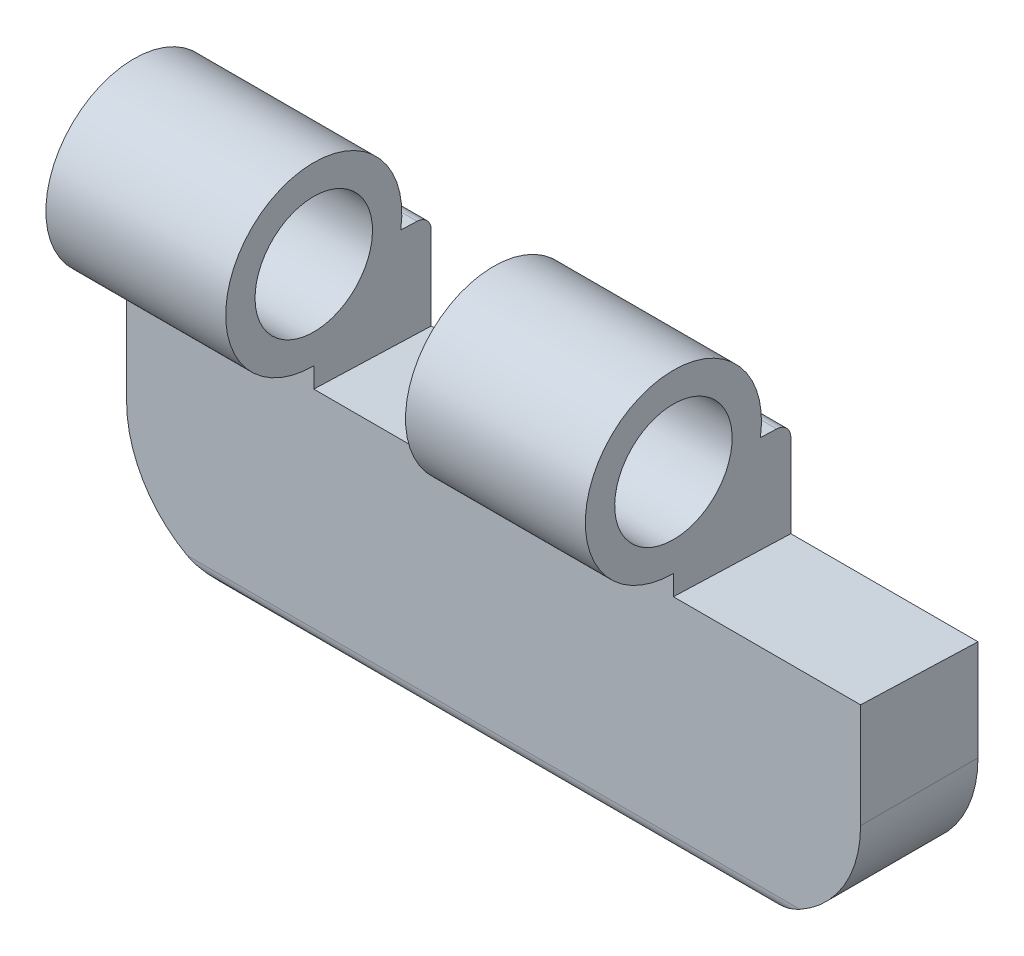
ISO-10303-21;
HEADER;
FILE_DESCRIPTION(('STEP AP214'),'2;1');
FILE_NAME('part.step','',(''),(''),'','','');
FILE_SCHEMA(('AUTOMOTIVE_DESIGN { 1 0 10303 214 1 1 1 1 }'));
ENDSEC;
DATA;
#1=APPLICATION_CONTEXT('core data for automotive mechanical design processes');
#2=APPLICATION_PROTOCOL_DEFINITION('international standard','automotive_design',2000,#1);
#3=PRODUCT_CONTEXT('',#1,'mechanical');
#4=PRODUCT('Part','Part','',(#3));
#5=PRODUCT_RELATED_PRODUCT_CATEGORY('part','',(#4));
#6=PRODUCT_DEFINITION_FORMATION('','',#4);
#7=PRODUCT_DEFINITION_CONTEXT('part definition',#1,'design');
#8=PRODUCT_DEFINITION('design','',#6,#7);
#9=PRODUCT_DEFINITION_SHAPE('','',#8);
#10=(LENGTH_UNIT() NAMED_UNIT(*) SI_UNIT(.MILLI.,.METRE.));
#11=(NAMED_UNIT(*) PLANE_ANGLE_UNIT() SI_UNIT($,.RADIAN.));
#12=(NAMED_UNIT(*) SI_UNIT($,.STERADIAN.) SOLID_ANGLE_UNIT());
#13=UNCERTAINTY_MEASURE_WITH_UNIT(LENGTH_MEASURE(1.E-05),#10,'distance_accuracy_value','');
#14=(GEOMETRIC_REPRESENTATION_CONTEXT(3) GLOBAL_UNCERTAINTY_ASSIGNED_CONTEXT((#13)) GLOBAL_UNIT_ASSIGNED_CONTEXT((#10,
#11,#12)) REPRESENTATION_CONTEXT('',''));
#15=CARTESIAN_POINT('',(0.,0.,0.));
#16=DIRECTION('',(0.,0.,1.));
#17=DIRECTION('',(1.,0.,0.));
#18=AXIS2_PLACEMENT_3D('',#15,#16,#17);
#19=CARTESIAN_POINT('',(-2.125,0.,7.));
#20=DIRECTION('',(0.,0.,1.));
#21=DIRECTION('',(-1.,0.,0.));
#22=AXIS2_PLACEMENT_3D('',#19,#20,#21);
#23=PLANE('',#22);
#24=CARTESIAN_POINT('',(0.,0.,7.));
#25=DIRECTION('',(0.,0.,-1.));
#26=DIRECTION('',(1.,0.,0.));
#27=AXIS2_PLACEMENT_3D('',#24,#25,#26);
#28=CIRCLE('',#27,4.25);
#29=CARTESIAN_POINT('',(4.25,0.,7.));
#30=VERTEX_POINT('',#29);
#31=EDGE_CURVE('E18',#30,#30,#28,.T.);
#32=ORIENTED_EDGE('',*,*,#31,.T.);
#33=EDGE_LOOP('',(#32));
#34=FACE_BOUND('',#33,.T.);
#35=ADVANCED_FACE('F14',(#34),#23,.F.);
#36=CARTESIAN_POINT('',(29.875,0.,7.));
#37=DIRECTION('',(0.,0.,1.));
#38=DIRECTION('',(-1.,0.,0.));
#39=AXIS2_PLACEMENT_3D('',#36,#37,#38);
#40=PLANE('',#39);
#41=CARTESIAN_POINT('',(32.,0.,7.));
#42=DIRECTION('',(0.,0.,-1.));
#43=DIRECTION('',(1.,0.,0.));
#44=AXIS2_PLACEMENT_3D('',#41,#42,#43);
#45=CIRCLE('',#44,4.25);
#46=CARTESIAN_POINT('',(36.25,0.,7.));
#47=VERTEX_POINT('',#46);
#48=EDGE_CURVE('E203',#47,#47,#45,.T.);
#49=ORIENTED_EDGE('',*,*,#48,.T.);
#50=EDGE_LOOP('',(#49));
#51=FACE_BOUND('',#50,.T.);
#52=ADVANCED_FACE('F448',(#51),#40,.F.);
#53=CARTESIAN_POINT('',(0.,0.,4.75));
#54=DIRECTION('',(0.,0.,-1.));
#55=DIRECTION('',(1.,0.,0.));
#56=AXIS2_PLACEMENT_3D('',#53,#54,#55);
#57=CYLINDRICAL_SURFACE('',#56,4.25);
#58=ORIENTED_EDGE('',*,*,#31,.F.);
#59=EDGE_LOOP('',(#58));
#60=FACE_BOUND('',#59,.T.);
#61=CARTESIAN_POINT('',(0.,0.,2.5));
#62=DIRECTION('',(0.,0.,-1.));
#63=DIRECTION('',(1.,0.,0.));
#64=AXIS2_PLACEMENT_3D('',#61,#62,#63);
#65=CIRCLE('',#64,4.25);
#66=CARTESIAN_POINT('',(4.25,0.,2.5));
#67=VERTEX_POINT('',#66);
#68=EDGE_CURVE('E433',#67,#67,#65,.T.);
#69=ORIENTED_EDGE('',*,*,#68,.T.);
#70=EDGE_LOOP('',(#69));
#71=FACE_BOUND('',#70,.T.);
#72=ADVANCED_FACE('F445',(#60,#71),#57,.F.);
#73=CARTESIAN_POINT('',(32.,0.,4.75));
#74=DIRECTION('',(0.,0.,-1.));
#75=DIRECTION('',(1.,0.,0.));
#76=AXIS2_PLACEMENT_3D('',#73,#74,#75);
#77=CYLINDRICAL_SURFACE('',#76,4.25);
#78=ORIENTED_EDGE('',*,*,#48,.F.);
#79=EDGE_LOOP('',(#78));
#80=FACE_BOUND('',#79,.T.);
#81=CARTESIAN_POINT('',(32.,0.,2.5));
#82=DIRECTION('',(0.,0.,-1.));
#83=DIRECTION('',(1.,0.,0.));
#84=AXIS2_PLACEMENT_3D('',#81,#82,#83);
#85=CIRCLE('',#84,4.25);
#86=CARTESIAN_POINT('',(36.25,0.,2.5));
#87=VERTEX_POINT('',#86);
#88=EDGE_CURVE('E132',#87,#87,#85,.T.);
#89=ORIENTED_EDGE('',*,*,#88,.T.);
#90=EDGE_LOOP('',(#89));
#91=FACE_BOUND('',#90,.T.);
#92=ADVANCED_FACE('F447',(#80,#91),#77,.F.);
#93=CARTESIAN_POINT('',(41.,4.85,0.));
#94=DIRECTION('',(0.,0.999390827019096,-0.034899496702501));
#95=DIRECTION('',(0.,-0.034899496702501,-0.999390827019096));
#96=AXIS2_PLACEMENT_3D('',#93,#94,#95);
#97=PLANE('',#96);
#98=DIRECTION('',(0.,0.0348994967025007,0.999390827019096));
#99=VECTOR('',#98,1.);
#100=CARTESIAN_POINT('',(-9.,4.85,0.));
#101=LINE('',#100,#99);
#102=CARTESIAN_POINT('',(-9.,4.85,0.));
#103=VERTEX_POINT('',#102);
#104=CARTESIAN_POINT('',(-9.,5.12936615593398,8.));
#105=VERTEX_POINT('',#104);
#106=EDGE_CURVE('E213',#103,#105,#101,.T.);
#107=ORIENTED_EDGE('',*,*,#106,.T.);
#108=DIRECTION('',(-1.,0.,0.));
#109=VECTOR('',#108,1.);
#110=CARTESIAN_POINT('',(41.,5.12936615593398,8.));
#111=LINE('',#110,#109);
#112=CARTESIAN_POINT('',(-8.5,5.12936615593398,8.));
#113=VERTEX_POINT('',#112);
#114=EDGE_CURVE('E190',#113,#105,#111,.T.);
#115=ORIENTED_EDGE('',*,*,#114,.F.);
#116=DIRECTION('',(0.,-0.0348994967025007,-0.999390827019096));
#117=VECTOR('',#116,1.);
#118=CARTESIAN_POINT('',(-8.5,5.12936615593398,8.));
#119=LINE('',#118,#117);
#120=CARTESIAN_POINT('',(-8.5,4.85,0.));
#121=VERTEX_POINT('',#120);
#122=EDGE_CURVE('E384',#113,#121,#119,.T.);
#123=ORIENTED_EDGE('',*,*,#122,.T.);
#124=DIRECTION('',(-1.,0.,0.));
#125=VECTOR('',#124,1.);
#126=CARTESIAN_POINT('',(41.,4.85,0.));
#127=LINE('',#126,#125);
#128=EDGE_CURVE('E200',#121,#103,#127,.T.);
#129=ORIENTED_EDGE('',*,*,#128,.T.);
#130=EDGE_LOOP('',(#107,#115,#123,#129));
#131=FACE_BOUND('',#130,.T.);
#132=ADVANCED_FACE('F455',(#131),#97,.T.);
#133=CARTESIAN_POINT('',(3.75,11.513702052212,0.965100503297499));
#134=DIRECTION('',(0.,0.999390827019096,-0.034899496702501));
#135=DIRECTION('',(0.,-0.034899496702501,-0.999390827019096));
#136=AXIS2_PLACEMENT_3D('',#133,#134,#135);
#137=PLANE('',#136);
#138=DIRECTION('',(0.,-0.034899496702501,-0.999390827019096));
#139=VECTOR('',#138,1.);
#140=CARTESIAN_POINT('',(3.75,11.513702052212,0.965100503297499));
#141=LINE('',#140,#139);
#142=CARTESIAN_POINT('',(3.75,11.5524707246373,2.07529002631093));
#143=VERTEX_POINT('',#142);
#144=CARTESIAN_POINT('',(3.75,11.513702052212,0.965100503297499));
#145=VERTEX_POINT('',#144);
#146=EDGE_CURVE('E193',#143,#145,#141,.T.);
#147=ORIENTED_EDGE('',*,*,#146,.T.);
#148=DIRECTION('',(1.,0.,0.));
#149=VECTOR('',#148,1.);
#150=CARTESIAN_POINT('',(3.75,11.513702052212,0.965100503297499));
#151=LINE('',#150,#149);
#152=CARTESIAN_POINT('',(-8.5,11.513702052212,0.965100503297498));
#153=VERTEX_POINT('',#152);
#154=EDGE_CURVE('E194',#153,#145,#151,.T.);
#155=ORIENTED_EDGE('',*,*,#154,.F.);
#156=DIRECTION('',(0.,0.0348994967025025,0.999390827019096));
#157=VECTOR('',#156,1.);
#158=CARTESIAN_POINT('',(-8.5,11.513702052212,0.965100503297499));
#159=LINE('',#158,#157);
#160=CARTESIAN_POINT('',(-8.5,11.5524707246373,2.07529002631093));
#161=VERTEX_POINT('',#160);
#162=EDGE_CURVE('E391',#153,#161,#159,.T.);
#163=ORIENTED_EDGE('',*,*,#162,.T.);
#164=DIRECTION('',(1.,0.,0.));
#165=VECTOR('',#164,1.);
#166=CARTESIAN_POINT('',(3.75,11.5524707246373,2.07529002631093));
#167=LINE('',#166,#165);
#168=EDGE_CURVE('E180',#143,#161,#167,.F.);
#169=ORIENTED_EDGE('',*,*,#168,.F.);
#170=EDGE_LOOP('',(#147,#155,#163,#169));
#171=FACE_BOUND('',#170,.T.);
#172=ADVANCED_FACE('F463',(#171),#137,.T.);
#173=CARTESIAN_POINT('',(3.75,12.5,8.));
#174=DIRECTION('',(1.,0.,0.));
#175=DIRECTION('',(0.,1.,0.));
#176=AXIS2_PLACEMENT_3D('',#173,#174,#175);
#177=CYLINDRICAL_SURFACE('',#176,4.);
#178=CARTESIAN_POINT('',(-8.5,12.5,8.));
#179=DIRECTION('',(1.,0.,0.));
#180=DIRECTION('',(0.,1.,0.));
#181=AXIS2_PLACEMENT_3D('',#178,#179,#180);
#182=CIRCLE('',#181,4.);
#183=CARTESIAN_POINT('',(-8.5,16.5,8.));
#184=VERTEX_POINT('',#183);
#185=EDGE_CURVE('E387',#184,#184,#182,.F.);
#186=ORIENTED_EDGE('',*,*,#185,.T.);
#187=EDGE_LOOP('',(#186));
#188=FACE_BOUND('',#187,.T.);
#189=CARTESIAN_POINT('',(3.75,12.5,8.));
#190=DIRECTION('',(1.,0.,0.));
#191=DIRECTION('',(0.,1.,0.));
#192=AXIS2_PLACEMENT_3D('',#189,#190,#191);
#193=CIRCLE('',#192,4.);
#194=CARTESIAN_POINT('',(3.75,16.5,8.));
#195=VERTEX_POINT('',#194);
#196=EDGE_CURVE('E197',#195,#195,#193,.F.);
#197=ORIENTED_EDGE('',*,*,#196,.F.);
#198=EDGE_LOOP('',(#197));
#199=FACE_BOUND('',#198,.T.);
#200=ADVANCED_FACE('F466',(#188,#199),#177,.F.);
#201=CARTESIAN_POINT('',(3.75,12.5,8.));
#202=DIRECTION('',(1.,0.,0.));
#203=DIRECTION('',(0.,1.,0.));
#204=AXIS2_PLACEMENT_3D('',#201,#202,#203);
#205=CYLINDRICAL_SURFACE('',#204,6.);
#206=DIRECTION('',(-1.,0.,0.));
#207=VECTOR('',#206,1.);
#208=CARTESIAN_POINT('',(41.,6.5,8.));
#209=LINE('',#208,#207);
#210=CARTESIAN_POINT('',(3.75,6.5,8.));
#211=VERTEX_POINT('',#210);
#212=CARTESIAN_POINT('',(-8.5,6.5,8.));
#213=VERTEX_POINT('',#212);
#214=EDGE_CURVE('E169',#211,#213,#209,.T.);
#215=ORIENTED_EDGE('',*,*,#214,.F.);
#216=CARTESIAN_POINT('',(3.75,12.5,8.));
#217=DIRECTION('',(1.,0.,0.));
#218=DIRECTION('',(0.,1.,0.));
#219=AXIS2_PLACEMENT_3D('',#216,#217,#218);
#220=CIRCLE('',#219,6.);
#221=EDGE_CURVE('E425',#143,#211,#220,.T.);
#222=ORIENTED_EDGE('',*,*,#221,.F.);
#223=ORIENTED_EDGE('',*,*,#168,.T.);
#224=CARTESIAN_POINT('',(-8.5,12.5,8.));
#225=DIRECTION('',(1.,0.,0.));
#226=DIRECTION('',(0.,1.,0.));
#227=AXIS2_PLACEMENT_3D('',#224,#225,#226);
#228=CIRCLE('',#227,6.);
#229=EDGE_CURVE('E428',#161,#213,#228,.T.);
#230=ORIENTED_EDGE('',*,*,#229,.T.);
#231=EDGE_LOOP('',(#215,#222,#223,#230));
#232=FACE_BOUND('',#231,.T.);
#233=ADVANCED_FACE('F470',(#232),#205,.T.);
#234=CARTESIAN_POINT('',(16.,11.5524707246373,2.07529002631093));
#235=DIRECTION('',(0.,0.999390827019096,-0.034899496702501));
#236=DIRECTION('',(0.,-0.034899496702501,-0.999390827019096));
#237=AXIS2_PLACEMENT_3D('',#234,#235,#236);
#238=PLANE('',#237);
#239=DIRECTION('',(0.,0.0348994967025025,0.999390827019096));
#240=VECTOR('',#239,1.);
#241=CARTESIAN_POINT('',(16.,11.513702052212,0.965100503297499));
#242=LINE('',#241,#240);
#243=CARTESIAN_POINT('',(16.,11.513702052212,0.965100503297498));
#244=VERTEX_POINT('',#243);
#245=CARTESIAN_POINT('',(16.,11.5524707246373,2.07529002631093));
#246=VERTEX_POINT('',#245);
#247=EDGE_CURVE('E184',#244,#246,#242,.T.);
#248=ORIENTED_EDGE('',*,*,#247,.T.);
#249=DIRECTION('',(-1.,0.,0.));
#250=VECTOR('',#249,1.);
#251=CARTESIAN_POINT('',(16.,11.5524707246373,2.07529002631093));
#252=LINE('',#251,#250);
#253=CARTESIAN_POINT('',(28.25,11.5524707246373,2.07529002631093));
#254=VERTEX_POINT('',#253);
#255=EDGE_CURVE('E170',#254,#246,#252,.T.);
#256=ORIENTED_EDGE('',*,*,#255,.F.);
#257=DIRECTION('',(0.,-0.034899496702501,-0.999390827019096));
#258=VECTOR('',#257,1.);
#259=CARTESIAN_POINT('',(28.25,11.5524707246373,2.07529002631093));
#260=LINE('',#259,#258);
#261=CARTESIAN_POINT('',(28.25,11.513702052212,0.965100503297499));
#262=VERTEX_POINT('',#261);
#263=EDGE_CURVE('E173',#254,#262,#260,.T.);
#264=ORIENTED_EDGE('',*,*,#263,.T.);
#265=DIRECTION('',(-1.,0.,0.));
#266=VECTOR('',#265,1.);
#267=CARTESIAN_POINT('',(16.,11.513702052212,0.9651005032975));
#268=LINE('',#267,#266);
#269=EDGE_CURVE('E174',#244,#262,#268,.F.);
#270=ORIENTED_EDGE('',*,*,#269,.F.);
#271=EDGE_LOOP('',(#248,#256,#264,#270));
#272=FACE_BOUND('',#271,.T.);
#273=ADVANCED_FACE('F474',(#272),#238,.T.);
#274=CARTESIAN_POINT('',(16.,12.5,8.));
#275=DIRECTION('',(-1.,0.,0.));
#276=DIRECTION('',(0.,-1.,0.));
#277=AXIS2_PLACEMENT_3D('',#274,#275,#276);
#278=CYLINDRICAL_SURFACE('',#277,4.);
#279=CARTESIAN_POINT('',(16.,12.5,8.));
#280=DIRECTION('',(-1.,0.,0.));
#281=DIRECTION('',(0.,-1.,0.));
#282=AXIS2_PLACEMENT_3D('',#279,#280,#281);
#283=CIRCLE('',#282,4.);
#284=CARTESIAN_POINT('',(16.,8.5,8.));
#285=VERTEX_POINT('',#284);
#286=EDGE_CURVE('E358',#285,#285,#283,.T.);
#287=ORIENTED_EDGE('',*,*,#286,.T.);
#288=EDGE_LOOP('',(#287));
#289=FACE_BOUND('',#288,.T.);
#290=CARTESIAN_POINT('',(28.25,12.5,8.));
#291=DIRECTION('',(-1.,0.,0.));
#292=DIRECTION('',(0.,-1.,0.));
#293=AXIS2_PLACEMENT_3D('',#290,#291,#292);
#294=CIRCLE('',#293,4.);
#295=CARTESIAN_POINT('',(28.25,8.5,8.));
#296=VERTEX_POINT('',#295);
#297=EDGE_CURVE('E177',#296,#296,#294,.T.);
#298=ORIENTED_EDGE('',*,*,#297,.F.);
#299=EDGE_LOOP('',(#298));
#300=FACE_BOUND('',#299,.T.);
#301=ADVANCED_FACE('F478',(#289,#300),#278,.F.);
#302=CARTESIAN_POINT('',(16.,12.5,8.));
#303=DIRECTION('',(-1.,0.,0.));
#304=DIRECTION('',(0.,-1.,0.));
#305=AXIS2_PLACEMENT_3D('',#302,#303,#304);
#306=CYLINDRICAL_SURFACE('',#305,6.);
#307=DIRECTION('',(-1.,0.,0.));
#308=VECTOR('',#307,1.);
#309=CARTESIAN_POINT('',(41.,6.5,8.));
#310=LINE('',#309,#308);
#311=CARTESIAN_POINT('',(28.25,6.5,8.));
#312=VERTEX_POINT('',#311);
#313=CARTESIAN_POINT('',(16.,6.5,8.));
#314=VERTEX_POINT('',#313);
#315=EDGE_CURVE('E166',#312,#314,#310,.T.);
#316=ORIENTED_EDGE('',*,*,#315,.F.);
#317=CARTESIAN_POINT('',(28.25,12.5,8.));
#318=DIRECTION('',(-1.,0.,0.));
#319=DIRECTION('',(0.,-1.,0.));
#320=AXIS2_PLACEMENT_3D('',#317,#318,#319);
#321=CIRCLE('',#320,6.);
#322=EDGE_CURVE('E237',#254,#312,#321,.F.);
#323=ORIENTED_EDGE('',*,*,#322,.F.);
#324=ORIENTED_EDGE('',*,*,#255,.T.);
#325=CARTESIAN_POINT('',(16.,12.5,8.));
#326=DIRECTION('',(-1.,0.,0.));
#327=DIRECTION('',(0.,-1.,0.));
#328=AXIS2_PLACEMENT_3D('',#325,#326,#327);
#329=CIRCLE('',#328,6.);
#330=EDGE_CURVE('E416',#246,#314,#329,.F.);
#331=ORIENTED_EDGE('',*,*,#330,.T.);
#332=EDGE_LOOP('',(#316,#323,#324,#331));
#333=FACE_BOUND('',#332,.T.);
#334=ADVANCED_FACE('F481',(#333),#306,.T.);
#335=CARTESIAN_POINT('',(41.,5.12936615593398,8.));
#336=DIRECTION('',(0.,0.,1.));
#337=DIRECTION('',(-1.,0.,0.));
#338=AXIS2_PLACEMENT_3D('',#335,#336,#337);
#339=PLANE('',#338);
#340=ORIENTED_EDGE('',*,*,#114,.T.);
#341=DIRECTION('',(0.,1.,0.));
#342=VECTOR('',#341,1.);
#343=CARTESIAN_POINT('',(-9.,12.5,8.));
#344=LINE('',#343,#342);
#345=CARTESIAN_POINT('',(-9.,-2.,8.));
#346=VERTEX_POINT('',#345);
#347=EDGE_CURVE('E210',#105,#346,#344,.F.);
#348=ORIENTED_EDGE('',*,*,#347,.T.);
#349=CARTESIAN_POINT('',(-1.,-2.,8.));
#350=DIRECTION('',(0.,0.,-1.));
#351=DIRECTION('',(1.,0.,0.));
#352=AXIS2_PLACEMENT_3D('',#349,#350,#351);
#353=CIRCLE('',#352,8.);
#354=CARTESIAN_POINT('',(-4.8729833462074,-9.,8.));
#355=VERTEX_POINT('',#354);
#356=EDGE_CURVE('E131',#355,#346,#353,.T.);
#357=ORIENTED_EDGE('',*,*,#356,.F.);
#358=DIRECTION('',(1.,0.,0.));
#359=VECTOR('',#358,1.);
#360=CARTESIAN_POINT('',(41.,-9.,8.));
#361=LINE('',#360,#359);
#362=CARTESIAN_POINT('',(36.8729833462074,-9.,8.));
#363=VERTEX_POINT('',#362);
#364=EDGE_CURVE('E127',#363,#355,#361,.F.);
#365=ORIENTED_EDGE('',*,*,#364,.F.);
#366=CARTESIAN_POINT('',(33.,-2.,8.));
#367=DIRECTION('',(0.,0.,-1.));
#368=DIRECTION('',(1.,0.,0.));
#369=AXIS2_PLACEMENT_3D('',#366,#367,#368);
#370=CIRCLE('',#369,8.);
#371=CARTESIAN_POINT('',(41.,-2.,8.));
#372=VERTEX_POINT('',#371);
#373=EDGE_CURVE('E141',#372,#363,#370,.T.);
#374=ORIENTED_EDGE('',*,*,#373,.F.);
#375=DIRECTION('',(0.,1.,0.));
#376=VECTOR('',#375,1.);
#377=CARTESIAN_POINT('',(41.,12.5,8.));
#378=LINE('',#377,#376);
#379=CARTESIAN_POINT('',(41.,5.12936615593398,8.));
#380=VERTEX_POINT('',#379);
#381=EDGE_CURVE('E154',#380,#372,#378,.F.);
#382=ORIENTED_EDGE('',*,*,#381,.F.);
#383=DIRECTION('',(-1.,0.,0.));
#384=VECTOR('',#383,1.);
#385=CARTESIAN_POINT('',(41.,5.12936615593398,8.));
#386=LINE('',#385,#384);
#387=CARTESIAN_POINT('',(28.25,5.12936615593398,8.));
#388=VERTEX_POINT('',#387);
#389=EDGE_CURVE('E160',#388,#380,#386,.F.);
#390=ORIENTED_EDGE('',*,*,#389,.F.);
#391=DIRECTION('',(0.,1.,0.));
#392=VECTOR('',#391,1.);
#393=CARTESIAN_POINT('',(28.25,12.5,8.));
#394=LINE('',#393,#392);
#395=EDGE_CURVE('E339',#312,#388,#394,.F.);
#396=ORIENTED_EDGE('',*,*,#395,.F.);
#397=ORIENTED_EDGE('',*,*,#315,.T.);
#398=DIRECTION('',(0.,1.,0.));
#399=VECTOR('',#398,1.);
#400=CARTESIAN_POINT('',(16.,12.5,8.));
#401=LINE('',#400,#399);
#402=CARTESIAN_POINT('',(16.,5.12936615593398,8.));
#403=VERTEX_POINT('',#402);
#404=EDGE_CURVE('E359',#314,#403,#401,.F.);
#405=ORIENTED_EDGE('',*,*,#404,.T.);
#406=DIRECTION('',(-1.,0.,0.));
#407=VECTOR('',#406,1.);
#408=CARTESIAN_POINT('',(41.,5.12936615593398,8.));
#409=LINE('',#408,#407);
#410=CARTESIAN_POINT('',(3.75,5.12936615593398,8.));
#411=VERTEX_POINT('',#410);
#412=EDGE_CURVE('E181',#411,#403,#409,.F.);
#413=ORIENTED_EDGE('',*,*,#412,.F.);
#414=DIRECTION('',(0.,1.,0.));
#415=VECTOR('',#414,1.);
#416=CARTESIAN_POINT('',(3.75,12.5,8.));
#417=LINE('',#416,#415);
#418=EDGE_CURVE('E369',#211,#411,#417,.F.);
#419=ORIENTED_EDGE('',*,*,#418,.F.);
#420=ORIENTED_EDGE('',*,*,#214,.T.);
#421=DIRECTION('',(0.,1.,0.));
#422=VECTOR('',#421,1.);
#423=CARTESIAN_POINT('',(-8.5,12.5,8.));
#424=LINE('',#423,#422);
#425=EDGE_CURVE('E388',#213,#113,#424,.F.);
#426=ORIENTED_EDGE('',*,*,#425,.T.);
#427=EDGE_LOOP('',(#340,#348,#357,#365,#374,#382,#390,#396,#397,#405,#413,#419,#420,#426));
#428=FACE_BOUND('',#427,.T.);
#429=ADVANCED_FACE('F248',(#428),#339,.T.);
#430=CARTESIAN_POINT('',(41.,-9.,7.));
#431=DIRECTION('',(1.,0.,0.));
#432=DIRECTION('',(0.,1.,0.));
#433=AXIS2_PLACEMENT_3D('',#430,#431,#432);
#434=CYLINDRICAL_SURFACE('',#433,1.);
#435=CARTESIAN_POINT('',(36.8729833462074,-9.,8.));
#436=CARTESIAN_POINT('',(36.8150611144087,-9.03204875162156,7.99999095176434));
#437=CARTESIAN_POINT('',(36.7567590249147,-9.06336585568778,7.99846056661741));
#438=CARTESIAN_POINT('',(36.6395251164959,-9.12448038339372,7.99269833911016));
#439=CARTESIAN_POINT('',(36.5805935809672,-9.15427845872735,7.98846766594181));
#440=CARTESIAN_POINT('',(36.4032423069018,-9.24121872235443,7.97225892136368));
#441=CARTESIAN_POINT('',(36.2840024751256,-9.2960525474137,7.95676097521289));
#442=CARTESIAN_POINT('',(36.0445697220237,-9.39915667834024,7.91852145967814));
#443=CARTESIAN_POINT('',(35.9243835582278,-9.447455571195,7.89581299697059));
#444=CARTESIAN_POINT('',(35.6828286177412,-9.53784294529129,7.84464292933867));
#445=CARTESIAN_POINT('',(35.5614590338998,-9.57992681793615,7.81617709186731));
#446=CARTESIAN_POINT('',(35.2403850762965,-9.68273685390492,7.73517218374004));
#447=CARTESIAN_POINT('',(35.0399619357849,-9.73829278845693,7.6788382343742));
#448=CARTESIAN_POINT('',(34.6377980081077,-9.83328651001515,7.55814944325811));
#449=CARTESIAN_POINT('',(34.4360567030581,-9.87271752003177,7.49379124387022));
#450=CARTESIAN_POINT('',(33.8292935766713,-9.96742194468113,7.29320124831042));
#451=CARTESIAN_POINT('',(33.422667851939,-9.99912712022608,7.14943568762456));
#452=CARTESIAN_POINT('',(33.0112434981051,-9.99999406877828,7.00397515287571));
#453=CARTESIAN_POINT('',(33.005621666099,-9.99999999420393,7.00198753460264));
#454=CARTESIAN_POINT('',(33.,-10.,7.));
#455=B_SPLINE_CURVE_WITH_KNOTS('',3,(#435,#436,#437,#438,#439,#440,#441,#442,#443,#444,#445,
#446,#447,#448,#449,#450,#451,#452,#453,#454),.UNSPECIFIED.,.F.,.F.,(4,2,2,2,2,2,2,2,2,4),(0.,
0.198535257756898,0.396984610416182,0.792983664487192,1.18719018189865,1.58168756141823,
2.22713013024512,2.87284368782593,4.16406208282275,4.18195063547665),.UNSPECIFIED.);
#456=CARTESIAN_POINT('',(33.,-10.,7.));
#457=VERTEX_POINT('',#456);
#458=EDGE_CURVE('E156',#363,#457,#455,.T.);
#459=ORIENTED_EDGE('',*,*,#458,.F.);
#460=ORIENTED_EDGE('',*,*,#364,.T.);
#461=CARTESIAN_POINT('',(-1.,-10.,7.));
#462=CARTESIAN_POINT('',(-0.999999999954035,-10.,7.00000113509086));
#463=CARTESIAN_POINT('',(-1.00000028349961,-9.9999999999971,7.00000227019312));
#464=CARTESIAN_POINT('',(-1.0000011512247,-9.99999999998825,7.00000443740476));
#465=CARTESIAN_POINT('',(-1.00000174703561,-9.99999999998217,7.00000546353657));
#466=CARTESIAN_POINT('',(-1.00000317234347,-9.99999999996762,7.00000752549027));
#467=CARTESIAN_POINT('',(-1.00000402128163,-9.99999999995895,7.00000854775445));
#468=CARTESIAN_POINT('',(-1.00000583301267,-9.99999999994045,7.0000104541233));
#469=CARTESIAN_POINT('',(-1.00000679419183,-9.99999999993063,7.00001133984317));
#470=CARTESIAN_POINT('',(-1.00001030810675,-9.99999999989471,7.00001438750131));
#471=CARTESIAN_POINT('',(-1.00001300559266,-9.99999999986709,7.0000163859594));
#472=CARTESIAN_POINT('',(-1.00001851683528,-9.99999999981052,7.00001987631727));
#473=CARTESIAN_POINT('',(-1.00002131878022,-9.99999999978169,7.00002138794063));
#474=CARTESIAN_POINT('',(-1.00003250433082,-9.99999999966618,7.00002724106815));
#475=CARTESIAN_POINT('',(-1.00004104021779,-9.99999999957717,7.0000313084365));
#476=CARTESIAN_POINT('',(-1.00005767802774,-9.99999999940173,7.00003778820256));
#477=CARTESIAN_POINT('',(-1.00006573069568,-9.99999999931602,7.00004032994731));
#478=CARTESIAN_POINT('',(-1.00010070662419,-9.99999999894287,7.00005141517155));
#479=CARTESIAN_POINT('',(-1.00012758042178,-9.99999999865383,7.00006004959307));
#480=CARTESIAN_POINT('',(-1.00017747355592,-9.99999999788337,7.00007361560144));
#481=CARTESIAN_POINT('',(-1.00020038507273,-9.99999999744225,7.0000789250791));
#482=CARTESIAN_POINT('',(-1.00036969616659,-9.99999999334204,7.00012172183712));
#483=CARTESIAN_POINT('',(-1.00051077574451,-9.9999999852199,7.00017732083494));
#484=CARTESIAN_POINT('',(-1.00106355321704,-9.9999999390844,7.00038730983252));
#485=CARTESIAN_POINT('',(-1.00147894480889,-9.99999987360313,7.00052818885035));
#486=CARTESIAN_POINT('',(-1.00310652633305,-9.99999949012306,7.00108820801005));
#487=CARTESIAN_POINT('',(-1.00431494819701,-9.99999892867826,7.00152150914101));
#488=CARTESIAN_POINT('',(-1.00930137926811,-9.9999954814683,7.00330123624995));
#489=CARTESIAN_POINT('',(-1.0130835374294,-9.99999019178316,7.00463162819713));
#490=CARTESIAN_POINT('',(-1.06010383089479,-9.99989110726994,7.0211821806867));
#491=CARTESIAN_POINT('',(-1.1033150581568,-9.9994497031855,7.03650704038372));
#492=CARTESIAN_POINT('',(-1.19040332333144,-9.99785412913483,7.0673077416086));
#493=CARTESIAN_POINT('',(-1.23428051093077,-9.99668924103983,7.08278234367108));
#494=CARTESIAN_POINT('',(-1.36187675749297,-9.99225031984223,7.12773209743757));
#495=CARTESIAN_POINT('',(-1.44558376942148,-9.9880215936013,7.15715678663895));
#496=CARTESIAN_POINT('',(-1.62314876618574,-9.97624836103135,7.21921672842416));
#497=CARTESIAN_POINT('',(-1.71700007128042,-9.9683624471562,7.25180602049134));
#498=CARTESIAN_POINT('',(-1.90558764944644,-9.94915023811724,7.31665261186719));
#499=CARTESIAN_POINT('',(-2.00032279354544,-9.93778846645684,7.34890276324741));
#500=CARTESIAN_POINT('',(-2.16430735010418,-9.91513020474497,7.40394308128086));
#501=CARTESIAN_POINT('',(-2.23359300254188,-9.90462980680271,7.42695538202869));
#502=CARTESIAN_POINT('',(-2.37188825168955,-9.88180321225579,7.47229823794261));
#503=CARTESIAN_POINT('',(-2.44089810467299,-9.86948166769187,7.49463036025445));
#504=CARTESIAN_POINT('',(-2.64458796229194,-9.83033569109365,7.55951422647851));
#505=CARTESIAN_POINT('',(-2.77910596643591,-9.80089013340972,7.60102919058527));
#506=CARTESIAN_POINT('',(-3.06607885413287,-9.73020509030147,7.6857492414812));
#507=CARTESIAN_POINT('',(-3.21843949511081,-9.6878973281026,7.72839300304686));
#508=CARTESIAN_POINT('',(-3.52307620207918,-9.59339942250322,7.80727586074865));
#509=CARTESIAN_POINT('',(-3.67534332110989,-9.54113855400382,7.84346529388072));
#510=CARTESIAN_POINT('',(-3.98767848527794,-9.4231617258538,7.90871697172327));
#511=CARTESIAN_POINT('',(-4.14763649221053,-9.356807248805,7.93718950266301));
#512=CARTESIAN_POINT('',(-4.38500747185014,-9.24908682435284,7.96919937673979));
#513=CARTESIAN_POINT('',(-4.46360517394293,-9.21186772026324,7.97808165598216));
#514=CARTESIAN_POINT('',(-4.61982425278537,-9.13473562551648,7.99165592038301));
#515=CARTESIAN_POINT('',(-4.6974459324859,-9.09482349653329,7.99634923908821));
#516=CARTESIAN_POINT('',(-4.84604497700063,-9.01530699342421,8.000618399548));
#517=CARTESIAN_POINT('',(-4.91710588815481,-8.97587815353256,8.00053073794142));
#518=CARTESIAN_POINT('',(-5.0578345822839,-8.89496625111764,7.99529461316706));
#519=CARTESIAN_POINT('',(-5.12750303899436,-8.85348421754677,7.99014866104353));
#520=CARTESIAN_POINT('',(-5.26405536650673,-8.76935502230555,7.97396695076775));
#521=CARTESIAN_POINT('',(-5.33096501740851,-8.72673363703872,7.9630180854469));
#522=CARTESIAN_POINT('',(-5.46240376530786,-8.64026548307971,7.93416664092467));
#523=CARTESIAN_POINT('',(-5.52693535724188,-8.59642008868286,7.91627159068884));
#524=CARTESIAN_POINT('',(-5.64559887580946,-8.51329739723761,7.87465801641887));
#525=CARTESIAN_POINT('',(-5.7000763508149,-8.47407086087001,7.85183904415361));
#526=CARTESIAN_POINT('',(-5.80576920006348,-8.39600685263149,7.79839598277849));
#527=CARTESIAN_POINT('',(-5.85697371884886,-8.35717100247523,7.76774745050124));
#528=CARTESIAN_POINT('',(-5.95510168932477,-8.28099249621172,7.69697158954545));
#529=CARTESIAN_POINT('',(-6.00196558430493,-8.24367370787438,7.65673364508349));
#530=CARTESIAN_POINT('',(-6.08831139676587,-8.17350433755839,7.56583531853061));
#531=CARTESIAN_POINT('',(-6.12782354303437,-8.14063561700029,7.51521949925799));
#532=CARTESIAN_POINT('',(-6.18254940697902,-8.09441693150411,7.42584158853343));
#533=CARTESIAN_POINT('',(-6.20115325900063,-8.07852521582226,7.39046500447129));
#534=CARTESIAN_POINT('',(-6.23373860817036,-8.05049089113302,7.31623102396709));
#535=CARTESIAN_POINT('',(-6.24772270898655,-8.03834617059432,7.27737560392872));
#536=CARTESIAN_POINT('',(-6.2703155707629,-8.01863814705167,7.19663930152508));
#537=CARTESIAN_POINT('',(-6.27888107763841,-8.01111172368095,7.15473697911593));
#538=CARTESIAN_POINT('',(-6.28980566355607,-8.00150083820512,7.06951996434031));
#539=CARTESIAN_POINT('',(-6.29216891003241,-7.99941272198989,7.026206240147));
#540=CARTESIAN_POINT('',(-6.29060372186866,-8.00079245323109,6.94474406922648));
#541=CARTESIAN_POINT('',(-6.28736099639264,-8.00365479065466,6.90656900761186));
#542=CARTESIAN_POINT('',(-6.27608015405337,-8.01357080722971,6.83150415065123));
#543=CARTESIAN_POINT('',(-6.26804175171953,-8.0206247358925,6.79461443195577));
#544=CARTESIAN_POINT('',(-6.24763954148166,-8.03841531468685,6.7230221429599));
#545=CARTESIAN_POINT('',(-6.23527697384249,-8.04915090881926,6.68831894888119));
#546=CARTESIAN_POINT('',(-6.20682543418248,-8.0736580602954,6.62164204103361));
#547=CARTESIAN_POINT('',(-6.19073501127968,-8.08743079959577,6.58966939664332));
#548=CARTESIAN_POINT('',(-6.14662481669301,-8.12482193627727,6.51353356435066));
#549=CARTESIAN_POINT('',(-6.11665453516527,-8.1499279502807,6.47122794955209));
#550=CARTESIAN_POINT('',(-6.05145565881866,-8.20359523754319,6.39338041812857));
#551=CARTESIAN_POINT('',(-6.01621335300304,-8.23216548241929,6.35785670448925));
#552=CARTESIAN_POINT('',(-5.92342831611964,-8.30593848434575,6.27710305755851));
#553=CARTESIAN_POINT('',(-5.86348485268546,-8.3523713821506,6.23577826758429));
#554=CARTESIAN_POINT('',(-5.73805560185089,-8.44647313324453,6.16508899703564));
#555=CARTESIAN_POINT('',(-5.67256771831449,-8.49414244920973,6.1357290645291));
#556=CARTESIAN_POINT('',(-5.54899064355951,-8.58114123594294,6.0908615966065));
#557=CARTESIAN_POINT('',(-5.49147527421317,-8.62054289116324,6.07386434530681));
#558=CARTESIAN_POINT('',(-5.37442560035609,-8.69845863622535,6.04564606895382));
#559=CARTESIAN_POINT('',(-5.31488985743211,-8.73697205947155,6.03442925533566));
#560=CARTESIAN_POINT('',(-5.19368651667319,-8.81308803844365,6.01683930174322));
#561=CARTESIAN_POINT('',(-5.13200327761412,-8.85067712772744,6.01051723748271));
#562=CARTESIAN_POINT('',(-5.00741560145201,-8.92429511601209,6.00218245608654));
#563=CARTESIAN_POINT('',(-4.94451071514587,-8.96032342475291,6.00017135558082));
#564=CARTESIAN_POINT('',(-4.76515668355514,-9.05982720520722,5.99971528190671));
#565=CARTESIAN_POINT('',(-4.64756702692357,-9.12128551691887,6.00561103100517));
#566=CARTESIAN_POINT('',(-4.41001555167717,-9.23805041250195,6.0269343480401));
#567=CARTESIAN_POINT('',(-4.29004934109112,-9.29334404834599,6.04238154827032));
#568=CARTESIAN_POINT('',(-4.05398728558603,-9.39519686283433,6.07987570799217));
#569=CARTESIAN_POINT('',(-3.9379590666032,-9.44203650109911,6.10159571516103));
#570=CARTESIAN_POINT('',(-3.70547967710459,-9.52965677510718,6.15031611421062));
#571=CARTESIAN_POINT('',(-3.58903404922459,-9.57046834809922,6.17728777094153));
#572=CARTESIAN_POINT('',(-3.38514241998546,-9.63671900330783,6.22808125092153));
#573=CARTESIAN_POINT('',(-3.2978660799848,-9.66342560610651,6.25095500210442));
#574=CARTESIAN_POINT('',(-3.12300858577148,-9.71369594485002,6.29868771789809));
#575=CARTESIAN_POINT('',(-3.03542762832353,-9.73726142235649,6.32354557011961));
#576=CARTESIAN_POINT('',(-2.85800422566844,-9.78179758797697,6.37550850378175));
#577=CARTESIAN_POINT('',(-2.7681552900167,-9.8026978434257,6.40265160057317));
#578=CARTESIAN_POINT('',(-2.58799361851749,-9.84135101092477,6.45844393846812));
#579=CARTESIAN_POINT('',(-2.49768028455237,-9.85909588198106,6.48709679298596));
#580=CARTESIAN_POINT('',(-2.28535804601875,-9.89703696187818,6.55575478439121));
#581=CARTESIAN_POINT('',(-2.16326968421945,-9.91593303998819,6.59623687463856));
#582=CARTESIAN_POINT('',(-1.92013032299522,-9.94784475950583,6.67827533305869));
#583=CARTESIAN_POINT('',(-1.79908182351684,-9.96091981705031,6.7198160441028));
#584=CARTESIAN_POINT('',(-1.62411162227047,-9.97580124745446,6.78049617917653));
#585=CARTESIAN_POINT('',(-1.57024208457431,-9.97983325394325,6.79926513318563));
#586=CARTESIAN_POINT('',(-1.46226195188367,-9.9868174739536,6.83702493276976));
#587=CARTESIAN_POINT('',(-1.40815126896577,-9.98976522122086,6.85601637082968));
#588=CARTESIAN_POINT('',(-1.29741873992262,-9.99467024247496,6.8949519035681));
#589=CARTESIAN_POINT('',(-1.24079596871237,-9.99657567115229,6.91489960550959));
#590=CARTESIAN_POINT('',(-1.12841584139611,-9.9991638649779,6.95462479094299));
#591=CARTESIAN_POINT('',(-1.07265832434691,-9.9998646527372,6.97440029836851));
#592=CARTESIAN_POINT('',(-1.01308246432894,-9.99999019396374,6.99536864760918));
#593=CARTESIAN_POINT('',(-1.00929927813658,-9.99999548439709,6.99669948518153));
#594=CARTESIAN_POINT('',(-1.00431260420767,-9.99999892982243,6.99847932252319));
#595=CARTESIAN_POINT('',(-1.00310497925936,-9.99999949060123,6.99891233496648));
#596=CARTESIAN_POINT('',(-1.00147840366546,-9.99999987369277,6.99947200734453));
#597=CARTESIAN_POINT('',(-1.00106321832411,-9.99999993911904,6.9996128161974));
#598=CARTESIAN_POINT('',(-1.00051068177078,-9.9999999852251,6.99982271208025));
#599=CARTESIAN_POINT('',(-1.00036963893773,-9.99999999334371,6.99987829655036));
#600=CARTESIAN_POINT('',(-1.00020036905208,-9.99999999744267,6.99992108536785));
#601=CARTESIAN_POINT('',(-1.00017746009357,-9.99999999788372,6.99992639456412));
#602=CARTESIAN_POINT('',(-1.00012757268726,-9.99999999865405,6.9999399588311));
#603=CARTESIAN_POINT('',(-1.00010070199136,-9.99999999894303,6.99994859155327));
#604=CARTESIAN_POINT('',(-1.00006572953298,-9.99999999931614,6.99995967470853));
#605=CARTESIAN_POINT('',(-1.00005767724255,-9.99999999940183,6.99996221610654));
#606=CARTESIAN_POINT('',(-1.00004104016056,-9.99999999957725,6.99996869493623));
#607=CARTESIAN_POINT('',(-1.0000325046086,-9.99999999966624,6.99997276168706));
#608=CARTESIAN_POINT('',(-1.00002131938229,-9.99999999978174,6.999978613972));
#609=CARTESIAN_POINT('',(-1.00001851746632,-9.99999999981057,6.99998012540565));
#610=CARTESIAN_POINT('',(-1.00001300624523,-9.99999999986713,6.99998361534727));
#611=CARTESIAN_POINT('',(-1.00001030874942,-9.99999999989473,6.99998561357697));
#612=CARTESIAN_POINT('',(-1.00000679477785,-9.99999999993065,6.99998866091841));
#613=CARTESIAN_POINT('',(-1.00000583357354,-9.99999999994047,6.99998954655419));
#614=CARTESIAN_POINT('',(-1.00000402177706,-9.99999999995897,6.99999145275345));
#615=CARTESIAN_POINT('',(-1.00000317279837,-9.99999999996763,6.99999247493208));
#616=CARTESIAN_POINT('',(-1.00000174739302,-9.99999999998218,6.99999453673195));
#617=CARTESIAN_POINT('',(-1.00000115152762,-9.99999999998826,6.99999556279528));
#618=CARTESIAN_POINT('',(-1.00000028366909,-9.99999999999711,6.99999772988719));
#619=CARTESIAN_POINT('',(-1.00000000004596,-10.,6.9999988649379));
#620=CARTESIAN_POINT('',(-1.,-10.,7.));
#621=B_SPLINE_CURVE_WITH_KNOTS('',3,(#461,#462,#463,#464,#465,#466,#467,#468,#469,#470,#471,
#472,#473,#474,#475,#476,#477,#478,#479,#480,#481,#482,#483,#484,#485,#486,#487,#488,#489,#490,
#491,#492,#493,#494,#495,#496,#497,#498,#499,#500,#501,#502,#503,#504,#505,#506,#507,#508,#509,
#510,#511,#512,#513,#514,#515,#516,#517,#518,#519,#520,#521,#522,#523,#524,#525,#526,#527,#528,
#529,#530,#531,#532,#533,#534,#535,#536,#537,#538,#539,#540,#541,#542,#543,#544,#545,#546,#547,
#548,#549,#550,#551,#552,#553,#554,#555,#556,#557,#558,#559,#560,#561,#562,#563,#564,#565,#566,
#567,#568,#569,#570,#571,#572,#573,#574,#575,#576,#577,#578,#579,#580,#581,#582,#583,#584,#585,
#586,#587,#588,#589,#590,#591,#592,#593,#594,#595,#596,#597,#598,#599,#600,#601,#602,#603,#604,
#605,#606,#607,#608,#609,#610,#611,#612,#613,#614,#615,#616,#617,#618,#619,#620),.UNSPECIFIED.,
.T.,.F.,(4,2,2,2,2,2,2,2,2,2,2,2,2,2,2,2,2,2,2,2,2,2,2,2,2,2,2,2,2,2,2,2,2,2,2,2,2,2,2,2,2,2,2,
2,2,2,2,2,2,2,2,2,2,2,2,2,2,2,2,2,2,2,2,2,2,2,2,2,2,2,2,2,2,2,2,2,2,2,2,4),(0.,
3.40698807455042E-06,6.95098753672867E-06,1.09194301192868E-05,1.48365709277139E-05,
2.48615345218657E-05,3.44048785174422E-05,6.26951660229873E-05,8.80001725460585E-05,
0.000172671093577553,0.000243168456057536,0.000696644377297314,0.00201374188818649,
0.0058634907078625,0.0178931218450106,0.155425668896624,0.295045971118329,0.561488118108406,
0.86041553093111,1.16250194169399,1.38375265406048,1.60444765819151,2.0357002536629,
2.52663985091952,3.02120774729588,3.54680912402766,3.80894423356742,4.07099586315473,
4.31462921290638,4.55814167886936,4.7981067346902,5.0378124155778,5.25011637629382,
5.46309140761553,5.67865342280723,5.89330849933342,6.02188854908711,6.15039600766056,
6.27991674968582,6.40935044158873,6.52404735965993,6.63875110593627,6.7534219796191,
6.86813755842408,7.03997635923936,7.2122700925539,7.46988659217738,7.72760092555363,
7.94258106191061,8.15771760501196,8.37506987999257,8.59250364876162,8.99026222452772,
9.38884109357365,9.76954965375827,10.1482308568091,10.4304395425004,10.7124911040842,
11.000898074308,11.2900297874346,11.6799025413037,12.0656990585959,12.2372547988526,
12.4095094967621,12.589694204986,12.7671589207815,12.7791918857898,12.7830390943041,
12.7843555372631,12.7848088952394,12.7848793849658,12.7849640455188,12.7849893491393,
12.785017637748,12.7850271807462,12.7850372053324,12.7850411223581,12.7850450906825,
12.7850486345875,12.7850520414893),.UNSPECIFIED.);
#622=CARTESIAN_POINT('',(-1.,-10.,7.));
#623=VERTEX_POINT('',#622);
#624=EDGE_CURVE('E121',#623,#355,#621,.T.);
#625=ORIENTED_EDGE('',*,*,#624,.F.);
#626=DIRECTION('',(1.,0.,0.));
#627=VECTOR('',#626,1.);
#628=CARTESIAN_POINT('',(41.,-10.,7.));
#629=LINE('',#628,#627);
#630=EDGE_CURVE('E126',#457,#623,#629,.F.);
#631=ORIENTED_EDGE('',*,*,#630,.F.);
#632=EDGE_LOOP('',(#459,#460,#625,#631));
#633=FACE_BOUND('',#632,.T.);
#634=ADVANCED_FACE('F124',(#633),#434,.T.);
#635=CARTESIAN_POINT('',(-3.25,0.,2.5));
#636=DIRECTION('',(0.,0.,-1.));
#637=DIRECTION('',(1.,0.,0.));
#638=AXIS2_PLACEMENT_3D('',#635,#636,#637);
#639=PLANE('',#638);
#640=CARTESIAN_POINT('',(0.,0.,2.5));
#641=DIRECTION('',(0.,0.,-1.));
#642=DIRECTION('',(1.,0.,0.));
#643=AXIS2_PLACEMENT_3D('',#640,#641,#642);
#644=CIRCLE('',#643,2.25);
#645=CARTESIAN_POINT('',(2.25,0.,2.5));
#646=VERTEX_POINT('',#645);
#647=EDGE_CURVE('E144',#646,#646,#644,.T.);
#648=ORIENTED_EDGE('',*,*,#647,.T.);
#649=EDGE_LOOP('',(#648));
#650=FACE_BOUND('',#649,.T.);
#651=ORIENTED_EDGE('',*,*,#68,.F.);
#652=EDGE_LOOP('',(#651));
#653=FACE_BOUND('',#652,.T.);
#654=ADVANCED_FACE('F247',(#650,#653),#639,.F.);
#655=CARTESIAN_POINT('',(28.75,0.,2.5));
#656=DIRECTION('',(0.,0.,-1.));
#657=DIRECTION('',(1.,0.,0.));
#658=AXIS2_PLACEMENT_3D('',#655,#656,#657);
#659=PLANE('',#658);
#660=CARTESIAN_POINT('',(32.,0.,2.5));
#661=DIRECTION('',(0.,0.,-1.));
#662=DIRECTION('',(1.,0.,0.));
#663=AXIS2_PLACEMENT_3D('',#660,#661,#662);
#664=CIRCLE('',#663,2.25);
#665=CARTESIAN_POINT('',(34.25,0.,2.5));
#666=VERTEX_POINT('',#665);
#667=EDGE_CURVE('E147',#666,#666,#664,.T.);
#668=ORIENTED_EDGE('',*,*,#667,.T.);
#669=EDGE_LOOP('',(#668));
#670=FACE_BOUND('',#669,.T.);
#671=ORIENTED_EDGE('',*,*,#88,.F.);
#672=EDGE_LOOP('',(#671));
#673=FACE_BOUND('',#672,.T.);
#674=ADVANCED_FACE('F265',(#670,#673),#659,.F.);
#675=CARTESIAN_POINT('',(-1.,-2.,0.));
#676=DIRECTION('',(0.,0.,-1.));
#677=DIRECTION('',(1.,0.,0.));
#678=AXIS2_PLACEMENT_3D('',#675,#676,#677);
#679=CYLINDRICAL_SURFACE('',#678,8.);
#680=CARTESIAN_POINT('',(-1.,-2.,0.));
#681=DIRECTION('',(0.,0.,-1.));
#682=DIRECTION('',(1.,0.,0.));
#683=AXIS2_PLACEMENT_3D('',#680,#681,#682);
#684=CIRCLE('',#683,8.);
#685=CARTESIAN_POINT('',(-1.,-10.,0.));
#686=VERTEX_POINT('',#685);
#687=CARTESIAN_POINT('',(-9.,-2.,0.));
#688=VERTEX_POINT('',#687);
#689=EDGE_CURVE('E138',#686,#688,#684,.T.);
#690=ORIENTED_EDGE('',*,*,#689,.F.);
#691=DIRECTION('',(0.,0.,1.));
#692=VECTOR('',#691,1.);
#693=CARTESIAN_POINT('',(-1.,-10.,7.));
#694=LINE('',#693,#692);
#695=EDGE_CURVE('E135',#623,#686,#694,.F.);
#696=ORIENTED_EDGE('',*,*,#695,.F.);
#697=ORIENTED_EDGE('',*,*,#624,.T.);
#698=ORIENTED_EDGE('',*,*,#356,.T.);
#699=DIRECTION('',(0.,0.,1.));
#700=VECTOR('',#699,1.);
#701=CARTESIAN_POINT('',(-9.,-2.,0.));
#702=LINE('',#701,#700);
#703=EDGE_CURVE('E212',#346,#688,#702,.F.);
#704=ORIENTED_EDGE('',*,*,#703,.T.);
#705=EDGE_LOOP('',(#690,#696,#697,#698,#704));
#706=FACE_BOUND('',#705,.T.);
#707=ADVANCED_FACE('F136',(#706),#679,.T.);
#708=CARTESIAN_POINT('',(-9.,12.5,0.));
#709=DIRECTION('',(1.,0.,0.));
#710=DIRECTION('',(0.,1.,0.));
#711=AXIS2_PLACEMENT_3D('',#708,#709,#710);
#712=PLANE('',#711);
#713=ORIENTED_EDGE('',*,*,#347,.F.);
#714=ORIENTED_EDGE('',*,*,#106,.F.);
#715=DIRECTION('',(0.,-1.,0.));
#716=VECTOR('',#715,1.);
#717=CARTESIAN_POINT('',(-9.,-10.,0.));
#718=LINE('',#717,#716);
#719=EDGE_CURVE('E224',#688,#103,#718,.F.);
#720=ORIENTED_EDGE('',*,*,#719,.F.);
#721=ORIENTED_EDGE('',*,*,#703,.F.);
#722=EDGE_LOOP('',(#713,#714,#720,#721));
#723=FACE_BOUND('',#722,.T.);
#724=ADVANCED_FACE('F264',(#723),#712,.F.);
#725=CARTESIAN_POINT('',(-8.5,12.5,0.));
#726=DIRECTION('',(1.,0.,0.));
#727=DIRECTION('',(0.,1.,0.));
#728=AXIS2_PLACEMENT_3D('',#725,#726,#727);
#729=PLANE('',#728);
#730=ORIENTED_EDGE('',*,*,#185,.F.);
#731=EDGE_LOOP('',(#730));
#732=FACE_BOUND('',#731,.T.);
#733=ORIENTED_EDGE('',*,*,#425,.F.);
#734=ORIENTED_EDGE('',*,*,#229,.F.);
#735=ORIENTED_EDGE('',*,*,#162,.F.);
#736=CARTESIAN_POINT('',(-8.5,10.5143112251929,1.));
#737=DIRECTION('',(1.,0.,0.));
#738=DIRECTION('',(0.,1.,0.));
#739=AXIS2_PLACEMENT_3D('',#736,#737,#738);
#740=CIRCLE('',#739,1.);
#741=CARTESIAN_POINT('',(-8.5,10.5143112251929,0.));
#742=VERTEX_POINT('',#741);
#743=EDGE_CURVE('E198',#742,#153,#740,.T.);
#744=ORIENTED_EDGE('',*,*,#743,.F.);
#745=DIRECTION('',(0.,-1.,0.));
#746=VECTOR('',#745,1.);
#747=CARTESIAN_POINT('',(-8.5,-10.,0.));
#748=LINE('',#747,#746);
#749=EDGE_CURVE('E379',#121,#742,#748,.F.);
#750=ORIENTED_EDGE('',*,*,#749,.F.);
#751=ORIENTED_EDGE('',*,*,#122,.F.);
#752=EDGE_LOOP('',(#733,#734,#735,#744,#750,#751));
#753=FACE_BOUND('',#752,.T.);
#754=ADVANCED_FACE('F268',(#732,#753),#729,.F.);
#755=CARTESIAN_POINT('',(3.75,10.5143112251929,1.));
#756=DIRECTION('',(1.,0.,0.));
#757=DIRECTION('',(0.,1.,0.));
#758=AXIS2_PLACEMENT_3D('',#755,#756,#757);
#759=CYLINDRICAL_SURFACE('',#758,1.);
#760=CARTESIAN_POINT('',(3.75,10.5143112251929,1.));
#761=DIRECTION('',(1.,0.,0.));
#762=DIRECTION('',(0.,1.,0.));
#763=AXIS2_PLACEMENT_3D('',#760,#761,#762);
#764=CIRCLE('',#763,1.);
#765=CARTESIAN_POINT('',(3.75,10.5143112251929,0.));
#766=VERTEX_POINT('',#765);
#767=EDGE_CURVE('E511',#766,#145,#764,.T.);
#768=ORIENTED_EDGE('',*,*,#767,.F.);
#769=DIRECTION('',(1.,0.,0.));
#770=VECTOR('',#769,1.);
#771=CARTESIAN_POINT('',(41.,10.5143112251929,0.));
#772=LINE('',#771,#770);
#773=EDGE_CURVE('E374',#742,#766,#772,.T.);
#774=ORIENTED_EDGE('',*,*,#773,.F.);
#775=ORIENTED_EDGE('',*,*,#743,.T.);
#776=ORIENTED_EDGE('',*,*,#154,.T.);
#777=EDGE_LOOP('',(#768,#774,#775,#776));
#778=FACE_BOUND('',#777,.T.);
#779=ADVANCED_FACE('F272',(#778),#759,.T.);
#780=CARTESIAN_POINT('',(3.75,12.5,0.));
#781=DIRECTION('',(1.,0.,0.));
#782=DIRECTION('',(0.,1.,0.));
#783=AXIS2_PLACEMENT_3D('',#780,#781,#782);
#784=PLANE('',#783);
#785=ORIENTED_EDGE('',*,*,#221,.T.);
#786=ORIENTED_EDGE('',*,*,#418,.T.);
#787=DIRECTION('',(0.,-0.034899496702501,-0.999390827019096));
#788=VECTOR('',#787,1.);
#789=CARTESIAN_POINT('',(3.75,4.85,0.));
#790=LINE('',#789,#788);
#791=CARTESIAN_POINT('',(3.75,4.85,0.));
#792=VERTEX_POINT('',#791);
#793=EDGE_CURVE('E185',#792,#411,#790,.F.);
#794=ORIENTED_EDGE('',*,*,#793,.F.);
#795=DIRECTION('',(0.,-1.,0.));
#796=VECTOR('',#795,1.);
#797=CARTESIAN_POINT('',(3.75,-10.,0.));
#798=LINE('',#797,#796);
#799=EDGE_CURVE('E364',#766,#792,#798,.T.);
#800=ORIENTED_EDGE('',*,*,#799,.F.);
#801=ORIENTED_EDGE('',*,*,#767,.T.);
#802=ORIENTED_EDGE('',*,*,#146,.F.);
#803=EDGE_LOOP('',(#785,#786,#794,#800,#801,#802));
#804=FACE_BOUND('',#803,.T.);
#805=ORIENTED_EDGE('',*,*,#196,.T.);
#806=EDGE_LOOP('',(#805));
#807=FACE_BOUND('',#806,.T.);
#808=ADVANCED_FACE('F276',(#804,#807),#784,.T.);
#809=CARTESIAN_POINT('',(41.,4.85,0.));
#810=DIRECTION('',(0.,0.999390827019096,-0.034899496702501));
#811=DIRECTION('',(0.,-0.034899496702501,-0.999390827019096));
#812=AXIS2_PLACEMENT_3D('',#809,#810,#811);
#813=PLANE('',#812);
#814=DIRECTION('',(0.,-0.0348994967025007,-0.999390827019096));
#815=VECTOR('',#814,1.);
#816=CARTESIAN_POINT('',(16.,5.12936615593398,8.));
#817=LINE('',#816,#815);
#818=CARTESIAN_POINT('',(16.,4.85,0.));
#819=VERTEX_POINT('',#818);
#820=EDGE_CURVE('E355',#403,#819,#817,.T.);
#821=ORIENTED_EDGE('',*,*,#820,.T.);
#822=DIRECTION('',(1.,0.,0.));
#823=VECTOR('',#822,1.);
#824=CARTESIAN_POINT('',(41.,4.85,0.));
#825=LINE('',#824,#823);
#826=EDGE_CURVE('E352',#792,#819,#825,.T.);
#827=ORIENTED_EDGE('',*,*,#826,.F.);
#828=ORIENTED_EDGE('',*,*,#793,.T.);
#829=ORIENTED_EDGE('',*,*,#412,.T.);
#830=EDGE_LOOP('',(#821,#827,#828,#829));
#831=FACE_BOUND('',#830,.T.);
#832=ADVANCED_FACE('F280',(#831),#813,.T.);
#833=CARTESIAN_POINT('',(16.,12.5,0.));
#834=DIRECTION('',(1.,0.,0.));
#835=DIRECTION('',(0.,1.,0.));
#836=AXIS2_PLACEMENT_3D('',#833,#834,#835);
#837=PLANE('',#836);
#838=ORIENTED_EDGE('',*,*,#286,.F.);
#839=EDGE_LOOP('',(#838));
#840=FACE_BOUND('',#839,.T.);
#841=ORIENTED_EDGE('',*,*,#404,.F.);
#842=ORIENTED_EDGE('',*,*,#330,.F.);
#843=ORIENTED_EDGE('',*,*,#247,.F.);
#844=CARTESIAN_POINT('',(16.,10.5143112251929,1.));
#845=DIRECTION('',(-1.,0.,0.));
#846=DIRECTION('',(0.,-1.,0.));
#847=AXIS2_PLACEMENT_3D('',#844,#845,#846);
#848=CIRCLE('',#847,1.);
#849=CARTESIAN_POINT('',(16.,10.5143112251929,0.));
#850=VERTEX_POINT('',#849);
#851=EDGE_CURVE('E178',#850,#244,#848,.F.);
#852=ORIENTED_EDGE('',*,*,#851,.F.);
#853=DIRECTION('',(0.,-1.,0.));
#854=VECTOR('',#853,1.);
#855=CARTESIAN_POINT('',(16.,-10.,0.));
#856=LINE('',#855,#854);
#857=EDGE_CURVE('E349',#819,#850,#856,.F.);
#858=ORIENTED_EDGE('',*,*,#857,.F.);
#859=ORIENTED_EDGE('',*,*,#820,.F.);
#860=EDGE_LOOP('',(#841,#842,#843,#852,#858,#859));
#861=FACE_BOUND('',#860,.T.);
#862=ADVANCED_FACE('F284',(#840,#861),#837,.F.);
#863=CARTESIAN_POINT('',(16.,10.5143112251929,1.));
#864=DIRECTION('',(-1.,0.,0.));
#865=DIRECTION('',(0.,-1.,0.));
#866=AXIS2_PLACEMENT_3D('',#863,#864,#865);
#867=CYLINDRICAL_SURFACE('',#866,1.);
#868=ORIENTED_EDGE('',*,*,#851,.T.);
#869=ORIENTED_EDGE('',*,*,#269,.T.);
#870=CARTESIAN_POINT('',(28.25,10.5143112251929,1.));
#871=DIRECTION('',(-1.,0.,0.));
#872=DIRECTION('',(0.,-1.,0.));
#873=AXIS2_PLACEMENT_3D('',#870,#871,#872);
#874=CIRCLE('',#873,1.);
#875=CARTESIAN_POINT('',(28.25,10.5143112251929,0.));
#876=VERTEX_POINT('',#875);
#877=EDGE_CURVE('E499',#876,#262,#874,.F.);
#878=ORIENTED_EDGE('',*,*,#877,.F.);
#879=DIRECTION('',(1.,0.,0.));
#880=VECTOR('',#879,1.);
#881=CARTESIAN_POINT('',(41.,10.5143112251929,0.));
#882=LINE('',#881,#880);
#883=EDGE_CURVE('E344',#850,#876,#882,.T.);
#884=ORIENTED_EDGE('',*,*,#883,.F.);
#885=EDGE_LOOP('',(#868,#869,#878,#884));
#886=FACE_BOUND('',#885,.T.);
#887=ADVANCED_FACE('F288',(#886),#867,.T.);
#888=CARTESIAN_POINT('',(28.25,12.5,0.));
#889=DIRECTION('',(1.,0.,0.));
#890=DIRECTION('',(0.,1.,0.));
#891=AXIS2_PLACEMENT_3D('',#888,#889,#890);
#892=PLANE('',#891);
#893=ORIENTED_EDGE('',*,*,#322,.T.);
#894=ORIENTED_EDGE('',*,*,#395,.T.);
#895=DIRECTION('',(0.,-0.034899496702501,-0.999390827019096));
#896=VECTOR('',#895,1.);
#897=CARTESIAN_POINT('',(28.25,4.85,0.));
#898=LINE('',#897,#896);
#899=CARTESIAN_POINT('',(28.25,4.85,0.));
#900=VERTEX_POINT('',#899);
#901=EDGE_CURVE('E163',#900,#388,#898,.F.);
#902=ORIENTED_EDGE('',*,*,#901,.F.);
#903=DIRECTION('',(0.,-1.,0.));
#904=VECTOR('',#903,1.);
#905=CARTESIAN_POINT('',(28.25,-10.,0.));
#906=LINE('',#905,#904);
#907=EDGE_CURVE('E334',#876,#900,#906,.T.);
#908=ORIENTED_EDGE('',*,*,#907,.F.);
#909=ORIENTED_EDGE('',*,*,#877,.T.);
#910=ORIENTED_EDGE('',*,*,#263,.F.);
#911=EDGE_LOOP('',(#893,#894,#902,#908,#909,#910));
#912=FACE_BOUND('',#911,.T.);
#913=ORIENTED_EDGE('',*,*,#297,.T.);
#914=EDGE_LOOP('',(#913));
#915=FACE_BOUND('',#914,.T.);
#916=ADVANCED_FACE('F292',(#912,#915),#892,.T.);
#917=CARTESIAN_POINT('',(41.,4.85,0.));
#918=DIRECTION('',(0.,0.999390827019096,-0.034899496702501));
#919=DIRECTION('',(0.,-0.034899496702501,-0.999390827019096));
#920=AXIS2_PLACEMENT_3D('',#917,#918,#919);
#921=PLANE('',#920);
#922=DIRECTION('',(0.,0.0348994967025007,0.999390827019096));
#923=VECTOR('',#922,1.);
#924=CARTESIAN_POINT('',(41.,4.85,0.));
#925=LINE('',#924,#923);
#926=CARTESIAN_POINT('',(41.,4.85,0.));
#927=VERTEX_POINT('',#926);
#928=EDGE_CURVE('E157',#927,#380,#925,.T.);
#929=ORIENTED_EDGE('',*,*,#928,.F.);
#930=DIRECTION('',(1.,0.,0.));
#931=VECTOR('',#930,1.);
#932=CARTESIAN_POINT('',(41.,4.85,0.));
#933=LINE('',#932,#931);
#934=EDGE_CURVE('E332',#900,#927,#933,.T.);
#935=ORIENTED_EDGE('',*,*,#934,.F.);
#936=ORIENTED_EDGE('',*,*,#901,.T.);
#937=ORIENTED_EDGE('',*,*,#389,.T.);
#938=EDGE_LOOP('',(#929,#935,#936,#937));
#939=FACE_BOUND('',#938,.T.);
#940=ADVANCED_FACE('F296',(#939),#921,.T.);
#941=CARTESIAN_POINT('',(41.,12.5,0.));
#942=DIRECTION('',(1.,0.,0.));
#943=DIRECTION('',(0.,1.,0.));
#944=AXIS2_PLACEMENT_3D('',#941,#942,#943);
#945=PLANE('',#944);
#946=ORIENTED_EDGE('',*,*,#928,.T.);
#947=ORIENTED_EDGE('',*,*,#381,.T.);
#948=DIRECTION('',(0.,0.,-1.));
#949=VECTOR('',#948,1.);
#950=CARTESIAN_POINT('',(41.,-2.,0.));
#951=LINE('',#950,#949);
#952=CARTESIAN_POINT('',(41.,-2.,0.));
#953=VERTEX_POINT('',#952);
#954=EDGE_CURVE('E229',#953,#372,#951,.F.);
#955=ORIENTED_EDGE('',*,*,#954,.F.);
#956=DIRECTION('',(0.,-1.,0.));
#957=VECTOR('',#956,1.);
#958=CARTESIAN_POINT('',(41.,-10.,0.));
#959=LINE('',#958,#957);
#960=EDGE_CURVE('E222',#927,#953,#959,.T.);
#961=ORIENTED_EDGE('',*,*,#960,.F.);
#962=EDGE_LOOP('',(#946,#947,#955,#961));
#963=FACE_BOUND('',#962,.T.);
#964=ADVANCED_FACE('F299',(#963),#945,.T.);
#965=CARTESIAN_POINT('',(33.,-2.,0.));
#966=DIRECTION('',(0.,0.,-1.));
#967=DIRECTION('',(1.,0.,0.));
#968=AXIS2_PLACEMENT_3D('',#965,#966,#967);
#969=CYLINDRICAL_SURFACE('',#968,8.);
#970=ORIENTED_EDGE('',*,*,#954,.T.);
#971=ORIENTED_EDGE('',*,*,#373,.T.);
#972=ORIENTED_EDGE('',*,*,#458,.T.);
#973=DIRECTION('',(0.,0.,1.));
#974=VECTOR('',#973,1.);
#975=CARTESIAN_POINT('',(33.,-10.,7.));
#976=LINE('',#975,#974);
#977=CARTESIAN_POINT('',(33.,-10.,0.));
#978=VERTEX_POINT('',#977);
#979=EDGE_CURVE('E33',#978,#457,#976,.T.);
#980=ORIENTED_EDGE('',*,*,#979,.F.);
#981=CARTESIAN_POINT('',(33.,-2.,0.));
#982=DIRECTION('',(0.,0.,-1.));
#983=DIRECTION('',(1.,0.,0.));
#984=AXIS2_PLACEMENT_3D('',#981,#982,#983);
#985=CIRCLE('',#984,8.);
#986=EDGE_CURVE('E219',#953,#978,#985,.T.);
#987=ORIENTED_EDGE('',*,*,#986,.F.);
#988=EDGE_LOOP('',(#970,#971,#972,#980,#987));
#989=FACE_BOUND('',#988,.T.);
#990=ADVANCED_FACE('F239',(#989),#969,.T.);
#991=CARTESIAN_POINT('',(41.,-10.,7.));
#992=DIRECTION('',(0.,-1.,0.));
#993=DIRECTION('',(1.,0.,0.));
#994=AXIS2_PLACEMENT_3D('',#991,#992,#993);
#995=PLANE('',#994);
#996=ORIENTED_EDGE('',*,*,#979,.T.);
#997=ORIENTED_EDGE('',*,*,#630,.T.);
#998=ORIENTED_EDGE('',*,*,#695,.T.);
#999=DIRECTION('',(1.,0.,0.));
#1000=VECTOR('',#999,1.);
#1001=CARTESIAN_POINT('',(41.,-10.,0.));
#1002=LINE('',#1001,#1000);
#1003=EDGE_CURVE('E218',#978,#686,#1002,.F.);
#1004=ORIENTED_EDGE('',*,*,#1003,.F.);
#1005=EDGE_LOOP('',(#996,#997,#998,#1004));
#1006=FACE_BOUND('',#1005,.T.);
#1007=ADVANCED_FACE('F143',(#1006),#995,.T.);
#1008=CARTESIAN_POINT('',(0.,0.,1.25));
#1009=DIRECTION('',(0.,0.,-1.));
#1010=DIRECTION('',(1.,0.,0.));
#1011=AXIS2_PLACEMENT_3D('',#1008,#1009,#1010);
#1012=CYLINDRICAL_SURFACE('',#1011,2.25);
#1013=CARTESIAN_POINT('',(0.,0.,0.));
#1014=DIRECTION('',(0.,0.,-1.));
#1015=DIRECTION('',(1.,0.,0.));
#1016=AXIS2_PLACEMENT_3D('',#1013,#1014,#1015);
#1017=CIRCLE('',#1016,2.25);
#1018=CARTESIAN_POINT('',(2.25,0.,0.));
#1019=VERTEX_POINT('',#1018);
#1020=EDGE_CURVE('E24',#1019,#1019,#1017,.F.);
#1021=ORIENTED_EDGE('',*,*,#1020,.F.);
#1022=EDGE_LOOP('',(#1021));
#1023=FACE_BOUND('',#1022,.T.);
#1024=ORIENTED_EDGE('',*,*,#647,.F.);
#1025=EDGE_LOOP('',(#1024));
#1026=FACE_BOUND('',#1025,.T.);
#1027=ADVANCED_FACE('F316',(#1023,#1026),#1012,.F.);
#1028=CARTESIAN_POINT('',(32.,0.,1.25));
#1029=DIRECTION('',(0.,0.,-1.));
#1030=DIRECTION('',(1.,0.,0.));
#1031=AXIS2_PLACEMENT_3D('',#1028,#1029,#1030);
#1032=CYLINDRICAL_SURFACE('',#1031,2.25);
#1033=CARTESIAN_POINT('',(32.,0.,0.));
#1034=DIRECTION('',(0.,0.,-1.));
#1035=DIRECTION('',(1.,0.,0.));
#1036=AXIS2_PLACEMENT_3D('',#1033,#1034,#1035);
#1037=CIRCLE('',#1036,2.25);
#1038=CARTESIAN_POINT('',(34.25,0.,0.));
#1039=VERTEX_POINT('',#1038);
#1040=EDGE_CURVE('E9',#1039,#1039,#1037,.F.);
#1041=ORIENTED_EDGE('',*,*,#1040,.F.);
#1042=EDGE_LOOP('',(#1041));
#1043=FACE_BOUND('',#1042,.T.);
#1044=ORIENTED_EDGE('',*,*,#667,.F.);
#1045=EDGE_LOOP('',(#1044));
#1046=FACE_BOUND('',#1045,.T.);
#1047=ADVANCED_FACE('F310',(#1043,#1046),#1032,.F.);
#1048=CARTESIAN_POINT('',(41.,-10.,0.));
#1049=DIRECTION('',(0.,0.,-1.));
#1050=DIRECTION('',(1.,0.,0.));
#1051=AXIS2_PLACEMENT_3D('',#1048,#1049,#1050);
#1052=PLANE('',#1051);
#1053=ORIENTED_EDGE('',*,*,#1040,.T.);
#1054=EDGE_LOOP('',(#1053));
#1055=FACE_BOUND('',#1054,.T.);
#1056=ORIENTED_EDGE('',*,*,#1020,.T.);
#1057=EDGE_LOOP('',(#1056));
#1058=FACE_BOUND('',#1057,.T.);
#1059=ORIENTED_EDGE('',*,*,#986,.T.);
#1060=ORIENTED_EDGE('',*,*,#1003,.T.);
#1061=ORIENTED_EDGE('',*,*,#689,.T.);
#1062=ORIENTED_EDGE('',*,*,#719,.T.);
#1063=ORIENTED_EDGE('',*,*,#128,.F.);
#1064=ORIENTED_EDGE('',*,*,#749,.T.);
#1065=ORIENTED_EDGE('',*,*,#773,.T.);
#1066=ORIENTED_EDGE('',*,*,#799,.T.);
#1067=ORIENTED_EDGE('',*,*,#826,.T.);
#1068=ORIENTED_EDGE('',*,*,#857,.T.);
#1069=ORIENTED_EDGE('',*,*,#883,.T.);
#1070=ORIENTED_EDGE('',*,*,#907,.T.);
#1071=ORIENTED_EDGE('',*,*,#934,.T.);
#1072=ORIENTED_EDGE('',*,*,#960,.T.);
#1073=EDGE_LOOP('',(#1059,#1060,#1061,#1062,#1063,#1064,#1065,#1066,#1067,#1068,#1069,#1070,
#1071,#1072));
#1074=FACE_BOUND('',#1073,.T.);
#1075=ADVANCED_FACE('F16',(#1055,#1058,#1074),#1052,.T.);
#1076=CLOSED_SHELL('',(#35,#52,#72,#92,#132,#172,#200,#233,#273,#301,#334,#429,#634,#654,#674,
#707,#724,#754,#779,#808,#832,#862,#887,#916,#940,#964,#990,#1007,#1027,#1047,#1075));
#1077=MANIFOLD_SOLID_BREP('B1',#1076);
#1078=ADVANCED_BREP_SHAPE_REPRESENTATION('',(#18,#1077),#14);
#1079=SHAPE_DEFINITION_REPRESENTATION(#9,#1078);
ENDSEC;
END-ISO-10303-21;
